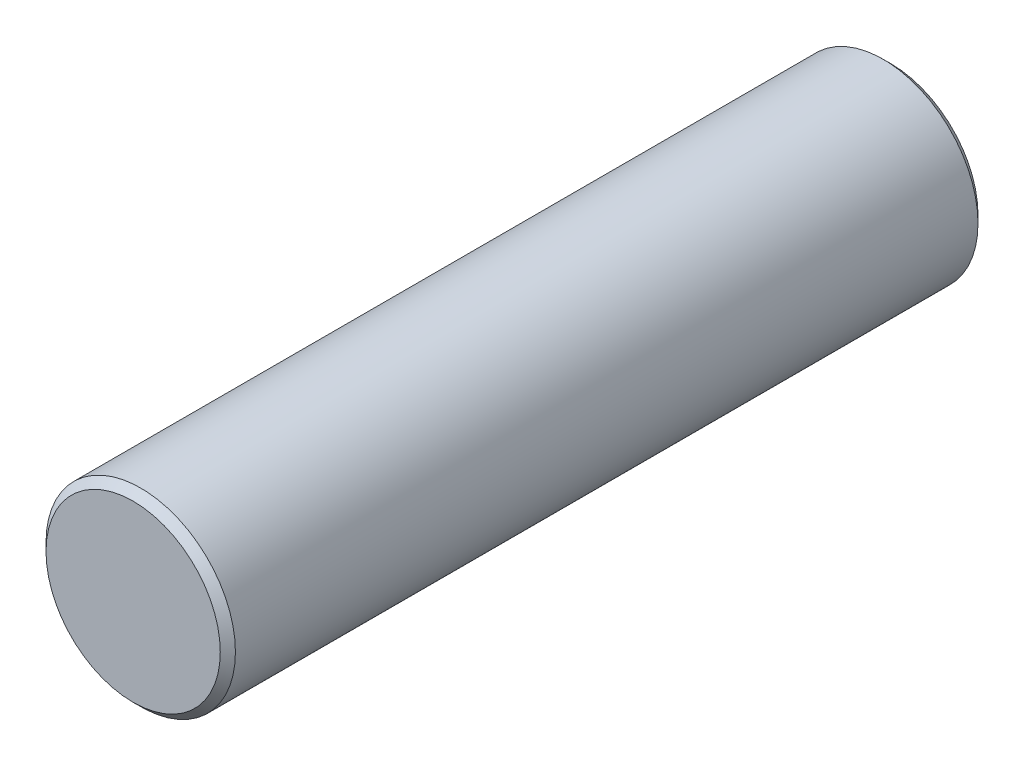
from build123d import *

# Parameters (mm, degrees)
SKETCH1_R           = 3.175
BOSS_EXTRUDE1_DEPTH = 25.4
CHAMFER1_SIZE       = 0.254


with BuildPart() as part:
    # Sketch1 → Boss-Extrude1 (new body)
    with BuildSketch(Plane.XY):
        Circle(SKETCH1_R)
    extrude(amount=BOSS_EXTRUDE1_DEPTH)

    # Chamfer1
    chamfer1_edges = [part.edges().sort_by_distance(p)[0] for p in [
        (-3.175, 0, 0),
        (-3.175, 0, 25.4),
    ]]
    chamfer(chamfer1_edges, length=CHAMFER1_SIZE)


solid = part.part
